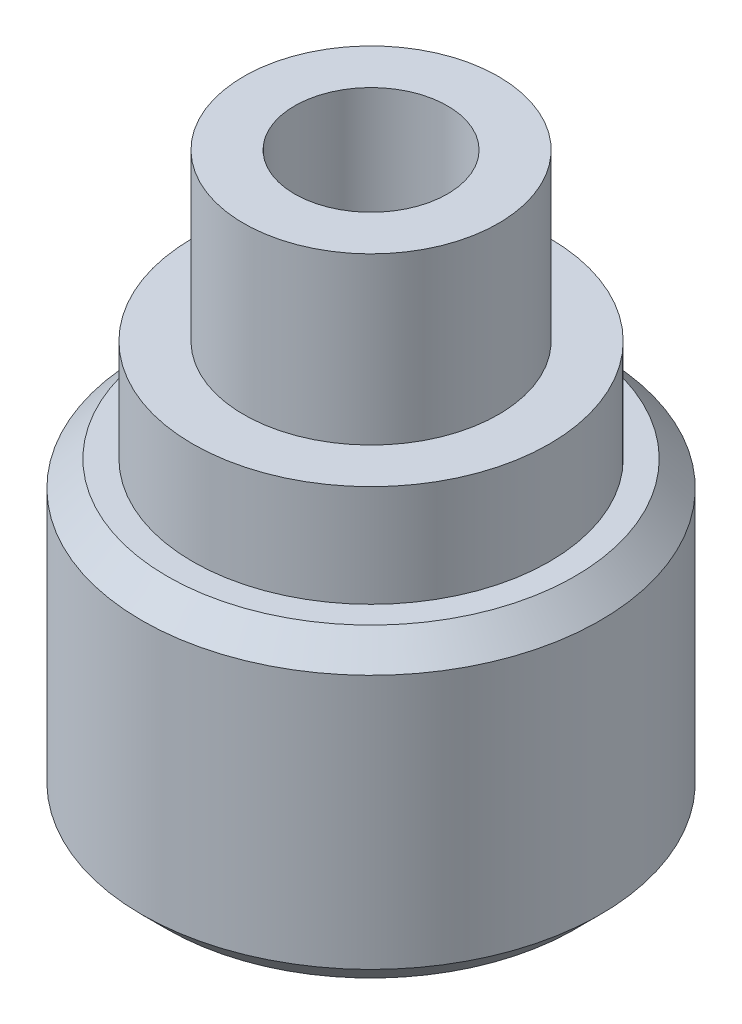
from build123d import *

# Parameters (mm, degrees)
SKETCH1_R                   = 9
EXTRUDE1_DEPTH              = 12
SKETCH2_R                   = 7
EXTRUDE2_DEPTH              = 4
SKETCH3_R                   = 5
EXTRUDE3_DEPTH              = 6.5
M6_TAPPED_HOLE1_D           = 5
M6_TAPPED_HOLE1_CBORE_D     = 6
M6_TAPPED_HOLE1_CBORE_DEPTH = 11.5
CHAMFER1_SIZE               = 1


with BuildPart() as part:
    # Sketch1 → Extrude1 (new body)
    with BuildSketch(Plane(origin=(0, 0, 0), x_dir=(1, 0, 0), z_dir=(0, 1, 0))):
        with Locations(Location((0, 0, 0), (0, 0, 270))):
            Circle(SKETCH1_R)
    extrude(amount=EXTRUDE1_DEPTH)

    # Sketch2 → Extrude2 (add)
    with BuildSketch(Plane(origin=(0, 12, 0), x_dir=(1, 0, 0), z_dir=(0, 1, 0))):
        with Locations(Location((0, 0, 0), (0, 0, 270))):
            Circle(SKETCH2_R)
    extrude(amount=EXTRUDE2_DEPTH)

    # Sketch3 → Extrude3 (add)
    with BuildSketch(Plane(origin=(0, 16, 0), x_dir=(1, 0, 0), z_dir=(0, 1, 0))):
        with Locations(Location((0, 0, 0), (0, 0, 90))):
            Circle(SKETCH3_R)
    extrude(amount=EXTRUDE3_DEPTH)

    # M6 Tapped Hole1 (through all)
    with Locations(Plane.ZX.offset(22.5)):
        with Locations((0, 0)):
            CounterBoreHole(M6_TAPPED_HOLE1_D / 2, M6_TAPPED_HOLE1_CBORE_D / 2, M6_TAPPED_HOLE1_CBORE_DEPTH)

    # Chamfer1
    chamfer1_edges = [part.edges().sort_by_distance(p)[0] for p in [
        (0, 0, -9),
        (0, 12, -9),
    ]]
    chamfer(chamfer1_edges, length=CHAMFER1_SIZE)


solid = part.part
